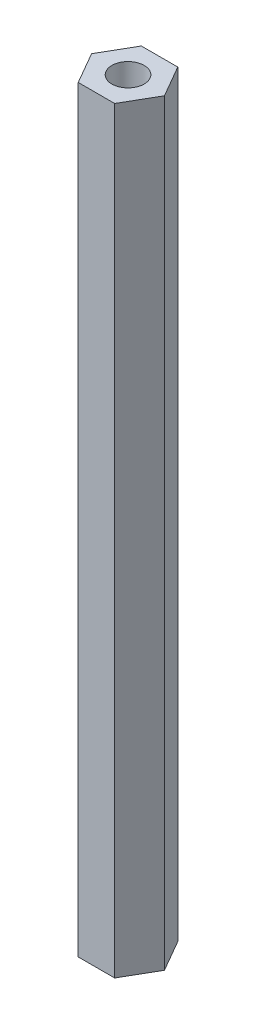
from build123d import *

# Parameters (mm, degrees)
SKETCH1_R           = 1.6256
BOSS_EXTRUDE1_DEPTH = 76.2


with BuildPart() as part:
    # Sketch1 → Boss-Extrude1 (new body)
    with BuildSketch(Plane(origin=(0, 0, 0), x_dir=(1, 0, 0), z_dir=(0, 1, 0))):
        Polygon((1.833087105, 3.175), (-1.833087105, 3.175), (-3.666174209, 0), (-1.833087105, -3.175), (1.833087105, -3.175), (3.666174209, 0), align=None)
        with Locations(Location((0, 0, 0), (0, 0, 90))):
            Circle(SKETCH1_R, mode=Mode.SUBTRACT)
    extrude(amount=BOSS_EXTRUDE1_DEPTH)


solid = part.part
